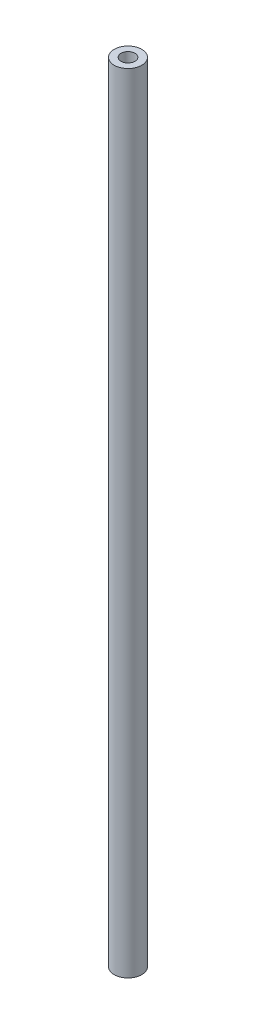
from build123d import *

# Parameters (mm, degrees)
SKETCH1_R                        = 4.7625
SKETCH1_R_2                      = 1.0795
BOSS_EXTRUDE1_DEPTH              = 271.78
F_10_32_TAPPED_HOLE1_D           = 4.0386
F_10_32_TAPPED_HOLE1_DEPTH       = 31.75
F_10_32_TAPPED_HOLE1_CBORE_D     = 4.826
F_10_32_TAPPED_HOLE1_CBORE_DEPTH = 25.4
F_10_32_TAPPED_HOLE1_TIP         = 1.213317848
F_10_32_TAPPED_HOLE2_D           = 4.0386
F_10_32_TAPPED_HOLE2_DEPTH       = 31.75
F_10_32_TAPPED_HOLE2_CBORE_D     = 4.826
F_10_32_TAPPED_HOLE2_CBORE_DEPTH = 25.4
F_10_32_TAPPED_HOLE2_TIP         = 1.213317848


with BuildPart() as part:
    # Sketch1 → Boss-Extrude1 (new body)
    with BuildSketch(Plane(origin=(0, 0, 0), x_dir=(1, 0, 0), z_dir=(0, 1, 0))):
        with Locations(Location((0, 0, 0), (0, 0, 270))):
            Circle(SKETCH1_R)
        with Locations(Location((0, 0, 0), (0, 0, 270))):
            Circle(SKETCH1_R_2, mode=Mode.SUBTRACT)
    extrude(amount=BOSS_EXTRUDE1_DEPTH)

    # 10-32 Tapped Hole1
    with Locations(Plane(origin=(0, 0, 0), x_dir=(-1, 0, 0), z_dir=(0, -1, 0))):
        with Locations((0, 0)):
            CounterBoreHole(F_10_32_TAPPED_HOLE1_D / 2, F_10_32_TAPPED_HOLE1_CBORE_D / 2, F_10_32_TAPPED_HOLE1_CBORE_DEPTH, depth=F_10_32_TAPPED_HOLE1_DEPTH)
            with Locations((0, 0, -(F_10_32_TAPPED_HOLE1_DEPTH + F_10_32_TAPPED_HOLE1_TIP / 2))):  # 118° drill point
                Cone(0, F_10_32_TAPPED_HOLE1_D / 2, F_10_32_TAPPED_HOLE1_TIP, mode=Mode.SUBTRACT)

    # 10-32 Tapped Hole2
    with Locations(Plane(origin=(0, 271.78, 0), x_dir=(1, 0, 0), z_dir=(0, 1, 0))):
        with Locations((0, 0)):
            CounterBoreHole(F_10_32_TAPPED_HOLE2_D / 2, F_10_32_TAPPED_HOLE2_CBORE_D / 2, F_10_32_TAPPED_HOLE2_CBORE_DEPTH, depth=F_10_32_TAPPED_HOLE2_DEPTH)
            with Locations((0, 0, -(F_10_32_TAPPED_HOLE2_DEPTH + F_10_32_TAPPED_HOLE2_TIP / 2))):  # 118° drill point
                Cone(0, F_10_32_TAPPED_HOLE2_D / 2, F_10_32_TAPPED_HOLE2_TIP, mode=Mode.SUBTRACT)


solid = part.part
